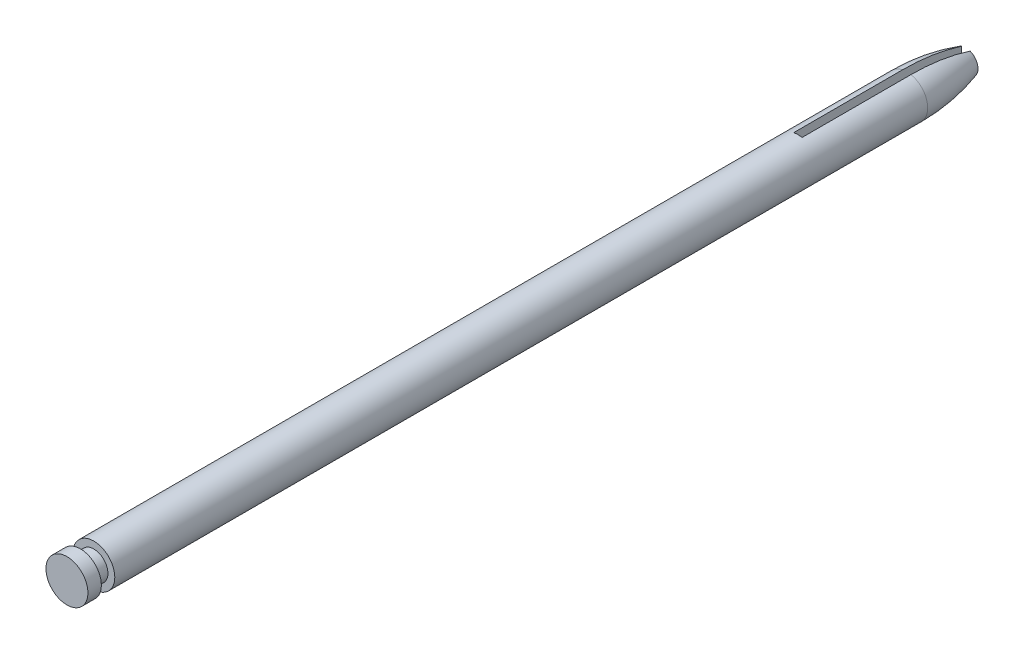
from build123d import *

# Parameters (mm, degrees)
SKETCH_2_W          = 0.79375
SKETCH_2_H          = 15.875
CUT_EXTRUDE_1_DEPTH = 2.54


with BuildPart() as part:
    # Sketch 1 → Revolve 1 (revolve)
    with BuildSketch(Plane(origin=(0, 0, 0), x_dir=(0, 0, -1), z_dir=(1, 0, 0)), mode=Mode.PRIVATE) as revolve_1_sk:
        with BuildLine():
            Line((84.93125, 0), (0, 0))
            Line((0, 0), (0, 1.9812))
            Line((0, 1.9812), (1.27, 1.9812))
            Line((1.27, 1.9812), (1.27, 1.3335))
            Line((1.27, 1.3335), (2.54, 1.3335))
            Line((2.54, 1.3335), (2.54, 1.9812))
            Line((2.54, 1.9812), (79.34325, 1.9812))
            ThreePointArc((79.34325, 1.9812), (82.168493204, 1.770533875), (84.93125, 1.143194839))
            Line((84.93125, 1.143194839), (84.93125, 0))
        make_face()
    revolve(revolve_1_sk.sketch.rotate(Axis((0, 0, 0), (0, 0, -1)), 90), axis=Axis((0, 0, 0), (0, 0, -1)))

    # Sketch 2 → Cut-Extrude 1 (cut, symmetric)
    with BuildSketch(Plane(origin=(0, 0, 0), x_dir=(1, 0, 0), z_dir=(0, 1, 0))):
        with Locations((0, 76.99375)):
            Rectangle(SKETCH_2_W, SKETCH_2_H)
    extrude(amount=CUT_EXTRUDE_1_DEPTH, both=True, mode=Mode.SUBTRACT)


solid = part.part
